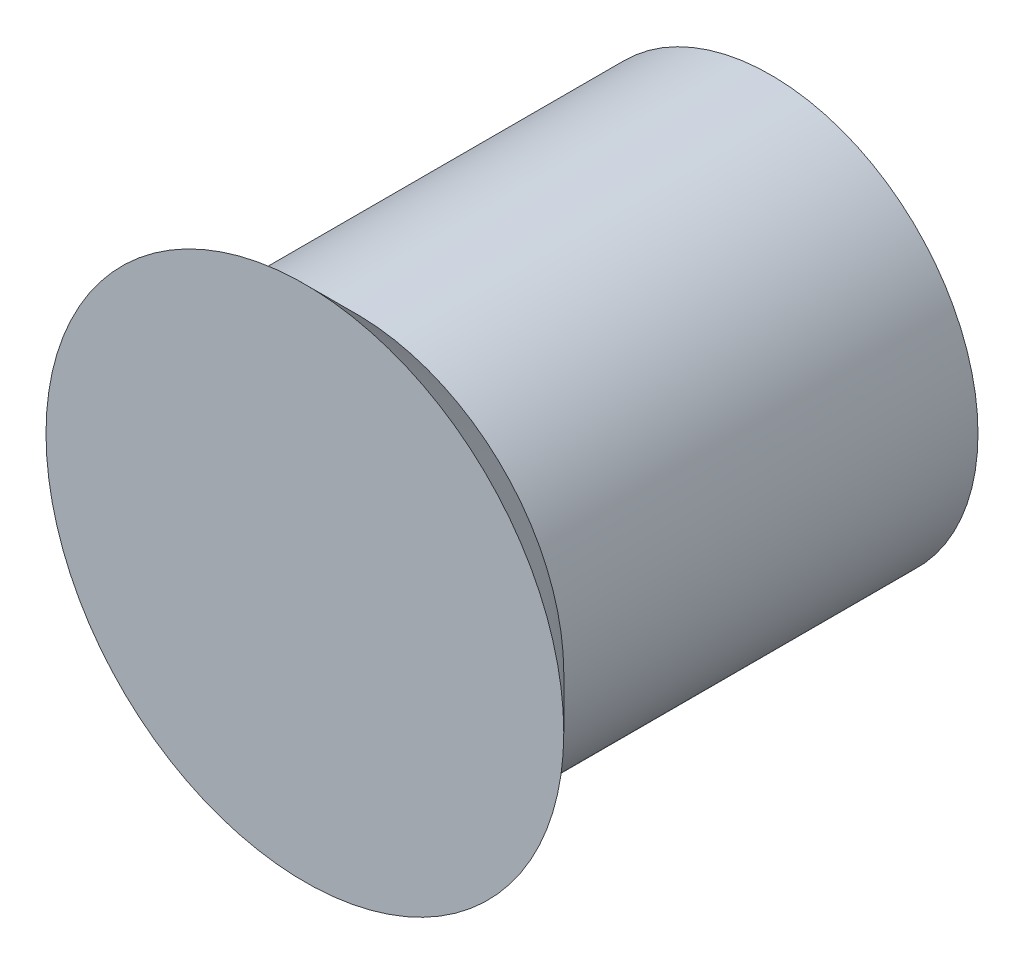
ISO-10303-21;
HEADER;
FILE_DESCRIPTION(('STEP AP214'),'2;1');
FILE_NAME('part.step','',(''),(''),'','','');
FILE_SCHEMA(('AUTOMOTIVE_DESIGN { 1 0 10303 214 1 1 1 1 }'));
ENDSEC;
DATA;
#1=APPLICATION_CONTEXT('core data for automotive mechanical design processes');
#2=APPLICATION_PROTOCOL_DEFINITION('international standard','automotive_design',2000,#1);
#3=PRODUCT_CONTEXT('',#1,'mechanical');
#4=PRODUCT('Part','Part','',(#3));
#5=PRODUCT_RELATED_PRODUCT_CATEGORY('part','',(#4));
#6=PRODUCT_DEFINITION_FORMATION('','',#4);
#7=PRODUCT_DEFINITION_CONTEXT('part definition',#1,'design');
#8=PRODUCT_DEFINITION('design','',#6,#7);
#9=PRODUCT_DEFINITION_SHAPE('','',#8);
#10=(LENGTH_UNIT() NAMED_UNIT(*) SI_UNIT(.MILLI.,.METRE.));
#11=(NAMED_UNIT(*) PLANE_ANGLE_UNIT() SI_UNIT($,.RADIAN.));
#12=(NAMED_UNIT(*) SI_UNIT($,.STERADIAN.) SOLID_ANGLE_UNIT());
#13=UNCERTAINTY_MEASURE_WITH_UNIT(LENGTH_MEASURE(1.E-05),#10,'distance_accuracy_value','');
#14=(GEOMETRIC_REPRESENTATION_CONTEXT(3) GLOBAL_UNCERTAINTY_ASSIGNED_CONTEXT((#13)) GLOBAL_UNIT_ASSIGNED_CONTEXT((#10,
#11,#12)) REPRESENTATION_CONTEXT('',''));
#15=CARTESIAN_POINT('',(0.,0.,0.));
#16=DIRECTION('',(0.,0.,1.));
#17=DIRECTION('',(1.,0.,0.));
#18=AXIS2_PLACEMENT_3D('',#15,#16,#17);
#19=CARTESIAN_POINT('',(0.,0.,8.));
#20=DIRECTION('',(0.,0.,-1.));
#21=DIRECTION('',(-1.,0.,0.));
#22=AXIS2_PLACEMENT_3D('',#19,#20,#21);
#23=CYLINDRICAL_SURFACE('',#22,4.);
#24=CARTESIAN_POINT('',(0.,0.,8.));
#25=DIRECTION('',(0.,0.,1.));
#26=DIRECTION('',(1.,0.,0.));
#27=AXIS2_PLACEMENT_3D('',#24,#25,#26);
#28=CIRCLE('',#27,4.);
#29=CARTESIAN_POINT('',(4.,0.,8.));
#30=VERTEX_POINT('',#29);
#31=EDGE_CURVE('E10',#30,#30,#28,.T.);
#32=ORIENTED_EDGE('',*,*,#31,.F.);
#33=EDGE_LOOP('',(#32));
#34=FACE_BOUND('',#33,.T.);
#35=CARTESIAN_POINT('',(0.,0.,0.));
#36=DIRECTION('',(0.,0.,1.));
#37=DIRECTION('',(1.,0.,0.));
#38=AXIS2_PLACEMENT_3D('',#35,#36,#37);
#39=CIRCLE('',#38,4.);
#40=CARTESIAN_POINT('',(4.,0.,0.));
#41=VERTEX_POINT('',#40);
#42=EDGE_CURVE('E34',#41,#41,#39,.T.);
#43=ORIENTED_EDGE('',*,*,#42,.T.);
#44=EDGE_LOOP('',(#43));
#45=FACE_BOUND('',#44,.T.);
#46=ADVANCED_FACE('F31',(#34,#45),#23,.T.);
#47=CARTESIAN_POINT('',(0.,0.,0.));
#48=DIRECTION('',(0.,0.,1.));
#49=DIRECTION('',(1.,0.,0.));
#50=AXIS2_PLACEMENT_3D('',#47,#48,#49);
#51=PLANE('',#50);
#52=ORIENTED_EDGE('',*,*,#42,.F.);
#53=EDGE_LOOP('',(#52));
#54=FACE_BOUND('',#53,.T.);
#55=ADVANCED_FACE('F50',(#54),#51,.F.);
#56=CARTESIAN_POINT('',(0.,0.,8.));
#57=DIRECTION('',(0.,0.,1.));
#58=DIRECTION('',(1.,0.,0.));
#59=AXIS2_PLACEMENT_3D('',#56,#57,#58);
#60=CONICAL_SURFACE('',#59,4.,0.78539816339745);
#61=CARTESIAN_POINT('',(0.,0.,9.));
#62=DIRECTION('',(0.,0.,1.));
#63=DIRECTION('',(1.,0.,0.));
#64=AXIS2_PLACEMENT_3D('',#61,#62,#63);
#65=CIRCLE('',#64,5.);
#66=CARTESIAN_POINT('',(5.,0.,9.));
#67=VERTEX_POINT('',#66);
#68=EDGE_CURVE('E41',#67,#67,#65,.T.);
#69=ORIENTED_EDGE('',*,*,#68,.F.);
#70=EDGE_LOOP('',(#69));
#71=FACE_BOUND('',#70,.T.);
#72=ORIENTED_EDGE('',*,*,#31,.T.);
#73=EDGE_LOOP('',(#72));
#74=FACE_BOUND('',#73,.T.);
#75=ADVANCED_FACE('F48',(#71,#74),#60,.T.);
#76=CARTESIAN_POINT('',(0.,0.,9.));
#77=DIRECTION('',(0.,0.,1.));
#78=DIRECTION('',(1.,0.,0.));
#79=AXIS2_PLACEMENT_3D('',#76,#77,#78);
#80=PLANE('',#79);
#81=ORIENTED_EDGE('',*,*,#68,.T.);
#82=EDGE_LOOP('',(#81));
#83=FACE_BOUND('',#82,.T.);
#84=ADVANCED_FACE('F46',(#83),#80,.T.);
#85=CLOSED_SHELL('',(#46,#55,#75,#84));
#86=MANIFOLD_SOLID_BREP('B2',#85);
#87=ADVANCED_BREP_SHAPE_REPRESENTATION('',(#18,#86),#14);
#88=SHAPE_DEFINITION_REPRESENTATION(#9,#87);
ENDSEC;
END-ISO-10303-21;
